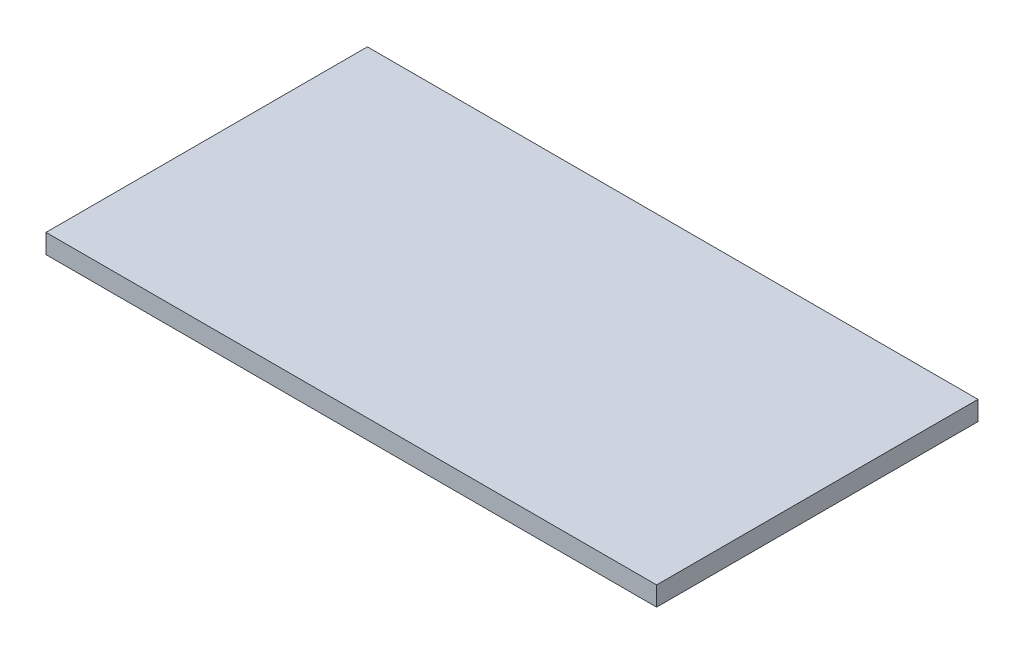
ISO-10303-21;
HEADER;
FILE_DESCRIPTION(('STEP AP214'),'2;1');
FILE_NAME('part.step','',(''),(''),'','','');
FILE_SCHEMA(('AUTOMOTIVE_DESIGN { 1 0 10303 214 1 1 1 1 }'));
ENDSEC;
DATA;
#1=APPLICATION_CONTEXT('core data for automotive mechanical design processes');
#2=APPLICATION_PROTOCOL_DEFINITION('international standard','automotive_design',2000,#1);
#3=PRODUCT_CONTEXT('',#1,'mechanical');
#4=PRODUCT('Part','Part','',(#3));
#5=PRODUCT_RELATED_PRODUCT_CATEGORY('part','',(#4));
#6=PRODUCT_DEFINITION_FORMATION('','',#4);
#7=PRODUCT_DEFINITION_CONTEXT('part definition',#1,'design');
#8=PRODUCT_DEFINITION('design','',#6,#7);
#9=PRODUCT_DEFINITION_SHAPE('','',#8);
#10=(LENGTH_UNIT() NAMED_UNIT(*) SI_UNIT(.MILLI.,.METRE.));
#11=(NAMED_UNIT(*) PLANE_ANGLE_UNIT() SI_UNIT($,.RADIAN.));
#12=(NAMED_UNIT(*) SI_UNIT($,.STERADIAN.) SOLID_ANGLE_UNIT());
#13=UNCERTAINTY_MEASURE_WITH_UNIT(LENGTH_MEASURE(1.E-05),#10,'distance_accuracy_value','');
#14=(GEOMETRIC_REPRESENTATION_CONTEXT(3) GLOBAL_UNCERTAINTY_ASSIGNED_CONTEXT((#13)) GLOBAL_UNIT_ASSIGNED_CONTEXT((#10,
#11,#12)) REPRESENTATION_CONTEXT('',''));
#15=CARTESIAN_POINT('',(0.,0.,0.));
#16=DIRECTION('',(0.,0.,1.));
#17=DIRECTION('',(1.,0.,0.));
#18=AXIS2_PLACEMENT_3D('',#15,#16,#17);
#19=CARTESIAN_POINT('',(0.,6.,0.));
#20=DIRECTION('',(0.,0.,-1.));
#21=DIRECTION('',(-1.,0.,0.));
#22=AXIS2_PLACEMENT_3D('',#19,#20,#21);
#23=PLANE('',#22);
#24=DIRECTION('',(1.,0.,0.));
#25=VECTOR('',#24,1.);
#26=CARTESIAN_POINT('',(0.,0.,0.));
#27=LINE('',#26,#25);
#28=CARTESIAN_POINT('',(-70.,0.,0.));
#29=VERTEX_POINT('',#28);
#30=CARTESIAN_POINT('',(120.,0.,0.));
#31=VERTEX_POINT('',#30);
#32=EDGE_CURVE('E73',#29,#31,#27,.T.);
#33=ORIENTED_EDGE('',*,*,#32,.T.);
#34=DIRECTION('',(0.,-1.,0.));
#35=VECTOR('',#34,1.);
#36=CARTESIAN_POINT('',(120.,6.,0.));
#37=LINE('',#36,#35);
#38=CARTESIAN_POINT('',(120.,6.,0.));
#39=VERTEX_POINT('',#38);
#40=EDGE_CURVE('E11',#39,#31,#37,.T.);
#41=ORIENTED_EDGE('',*,*,#40,.F.);
#42=DIRECTION('',(1.,0.,0.));
#43=VECTOR('',#42,1.);
#44=CARTESIAN_POINT('',(0.,6.,0.));
#45=LINE('',#44,#43);
#46=CARTESIAN_POINT('',(-70.,6.,0.));
#47=VERTEX_POINT('',#46);
#48=EDGE_CURVE('E99',#47,#39,#45,.T.);
#49=ORIENTED_EDGE('',*,*,#48,.F.);
#50=DIRECTION('',(0.,1.,0.));
#51=VECTOR('',#50,1.);
#52=CARTESIAN_POINT('',(-70.,6.,0.));
#53=LINE('',#52,#51);
#54=EDGE_CURVE('E108',#29,#47,#53,.T.);
#55=ORIENTED_EDGE('',*,*,#54,.F.);
#56=EDGE_LOOP('',(#33,#41,#49,#55));
#57=FACE_BOUND('',#56,.T.);
#58=ADVANCED_FACE('F45',(#57),#23,.F.);
#59=CARTESIAN_POINT('',(120.,6.,0.));
#60=DIRECTION('',(-1.,0.,0.));
#61=DIRECTION('',(0.,0.,1.));
#62=AXIS2_PLACEMENT_3D('',#59,#60,#61);
#63=PLANE('',#62);
#64=DIRECTION('',(0.,0.,-1.));
#65=VECTOR('',#64,1.);
#66=CARTESIAN_POINT('',(120.,0.,0.));
#67=LINE('',#66,#65);
#68=CARTESIAN_POINT('',(120.,0.,-100.));
#69=VERTEX_POINT('',#68);
#70=EDGE_CURVE('E100',#31,#69,#67,.T.);
#71=ORIENTED_EDGE('',*,*,#70,.T.);
#72=DIRECTION('',(0.,-1.,0.));
#73=VECTOR('',#72,1.);
#74=CARTESIAN_POINT('',(120.,6.,-100.));
#75=LINE('',#74,#73);
#76=CARTESIAN_POINT('',(120.,6.,-100.));
#77=VERTEX_POINT('',#76);
#78=EDGE_CURVE('E54',#77,#69,#75,.T.);
#79=ORIENTED_EDGE('',*,*,#78,.F.);
#80=DIRECTION('',(0.,0.,-1.));
#81=VECTOR('',#80,1.);
#82=CARTESIAN_POINT('',(120.,6.,0.));
#83=LINE('',#82,#81);
#84=EDGE_CURVE('E62',#39,#77,#83,.T.);
#85=ORIENTED_EDGE('',*,*,#84,.F.);
#86=ORIENTED_EDGE('',*,*,#40,.T.);
#87=EDGE_LOOP('',(#71,#79,#85,#86));
#88=FACE_BOUND('',#87,.T.);
#89=ADVANCED_FACE('F130',(#88),#63,.F.);
#90=CARTESIAN_POINT('',(0.,6.,-100.));
#91=DIRECTION('',(0.,0.,1.));
#92=DIRECTION('',(1.,0.,0.));
#93=AXIS2_PLACEMENT_3D('',#90,#91,#92);
#94=PLANE('',#93);
#95=DIRECTION('',(-1.,0.,0.));
#96=VECTOR('',#95,1.);
#97=CARTESIAN_POINT('',(0.,0.,-100.));
#98=LINE('',#97,#96);
#99=CARTESIAN_POINT('',(-70.,0.,-100.));
#100=VERTEX_POINT('',#99);
#101=EDGE_CURVE('E91',#69,#100,#98,.T.);
#102=ORIENTED_EDGE('',*,*,#101,.T.);
#103=DIRECTION('',(0.,-1.,0.));
#104=VECTOR('',#103,1.);
#105=CARTESIAN_POINT('',(-70.,6.,-100.));
#106=LINE('',#105,#104);
#107=CARTESIAN_POINT('',(-70.,6.,-100.));
#108=VERTEX_POINT('',#107);
#109=EDGE_CURVE('E95',#108,#100,#106,.T.);
#110=ORIENTED_EDGE('',*,*,#109,.F.);
#111=DIRECTION('',(-1.,0.,0.));
#112=VECTOR('',#111,1.);
#113=CARTESIAN_POINT('',(0.,6.,-100.));
#114=LINE('',#113,#112);
#115=EDGE_CURVE('E78',#77,#108,#114,.T.);
#116=ORIENTED_EDGE('',*,*,#115,.F.);
#117=ORIENTED_EDGE('',*,*,#78,.T.);
#118=EDGE_LOOP('',(#102,#110,#116,#117));
#119=FACE_BOUND('',#118,.T.);
#120=ADVANCED_FACE('F93',(#119),#94,.F.);
#121=CARTESIAN_POINT('',(0.,6.,0.));
#122=DIRECTION('',(0.,-1.,0.));
#123=DIRECTION('',(0.,0.,-1.));
#124=AXIS2_PLACEMENT_3D('',#121,#122,#123);
#125=PLANE('',#124);
#126=ORIENTED_EDGE('',*,*,#115,.T.);
#127=DIRECTION('',(0.,0.,-1.));
#128=VECTOR('',#127,1.);
#129=CARTESIAN_POINT('',(-70.,6.,-100.));
#130=LINE('',#129,#128);
#131=EDGE_CURVE('E111',#47,#108,#130,.T.);
#132=ORIENTED_EDGE('',*,*,#131,.F.);
#133=ORIENTED_EDGE('',*,*,#48,.T.);
#134=ORIENTED_EDGE('',*,*,#84,.T.);
#135=EDGE_LOOP('',(#126,#132,#133,#134));
#136=FACE_BOUND('',#135,.T.);
#137=ADVANCED_FACE('F131',(#136),#125,.F.);
#138=CARTESIAN_POINT('',(0.,0.,0.));
#139=DIRECTION('',(0.,-1.,0.));
#140=DIRECTION('',(0.,0.,-1.));
#141=AXIS2_PLACEMENT_3D('',#138,#139,#140);
#142=PLANE('',#141);
#143=ORIENTED_EDGE('',*,*,#32,.F.);
#144=DIRECTION('',(0.,0.,1.));
#145=VECTOR('',#144,1.);
#146=CARTESIAN_POINT('',(-70.,0.,-100.));
#147=LINE('',#146,#145);
#148=EDGE_CURVE('E103',#100,#29,#147,.T.);
#149=ORIENTED_EDGE('',*,*,#148,.F.);
#150=ORIENTED_EDGE('',*,*,#101,.F.);
#151=ORIENTED_EDGE('',*,*,#70,.F.);
#152=EDGE_LOOP('',(#143,#149,#150,#151));
#153=FACE_BOUND('',#152,.T.);
#154=ADVANCED_FACE('F104',(#153),#142,.T.);
#155=CARTESIAN_POINT('',(-70.,0.,0.));
#156=DIRECTION('',(-1.,0.,0.));
#157=DIRECTION('',(0.,0.,1.));
#158=AXIS2_PLACEMENT_3D('',#155,#156,#157);
#159=PLANE('',#158);
#160=ORIENTED_EDGE('',*,*,#109,.T.);
#161=ORIENTED_EDGE('',*,*,#148,.T.);
#162=ORIENTED_EDGE('',*,*,#54,.T.);
#163=ORIENTED_EDGE('',*,*,#131,.T.);
#164=EDGE_LOOP('',(#160,#161,#162,#163));
#165=FACE_BOUND('',#164,.T.);
#166=ADVANCED_FACE('F110',(#165),#159,.T.);
#167=CLOSED_SHELL('',(#58,#89,#120,#137,#154,#166));
#168=MANIFOLD_SOLID_BREP('B2',#167);
#169=ADVANCED_BREP_SHAPE_REPRESENTATION('',(#18,#168),#14);
#170=SHAPE_DEFINITION_REPRESENTATION(#9,#169);
ENDSEC;
END-ISO-10303-21;
